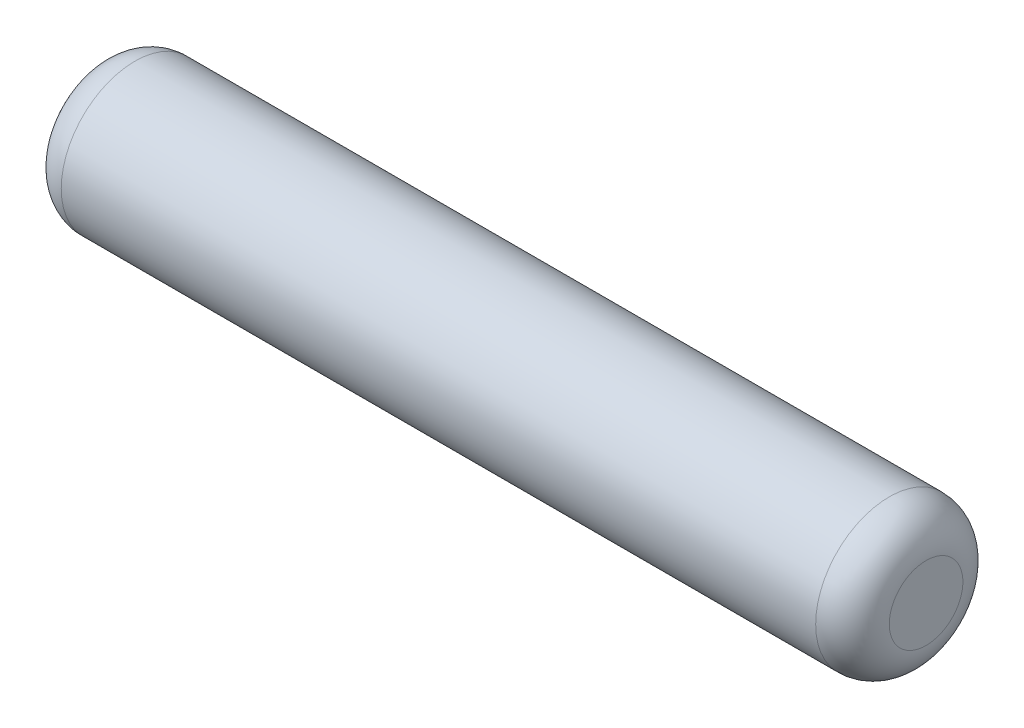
ISO-10303-21;
HEADER;
FILE_DESCRIPTION(('STEP AP214'),'2;1');
FILE_NAME('part.step','',(''),(''),'','','');
FILE_SCHEMA(('AUTOMOTIVE_DESIGN { 1 0 10303 214 1 1 1 1 }'));
ENDSEC;
DATA;
#1=APPLICATION_CONTEXT('core data for automotive mechanical design processes');
#2=APPLICATION_PROTOCOL_DEFINITION('international standard','automotive_design',2000,#1);
#3=PRODUCT_CONTEXT('',#1,'mechanical');
#4=PRODUCT('Part','Part','',(#3));
#5=PRODUCT_RELATED_PRODUCT_CATEGORY('part','',(#4));
#6=PRODUCT_DEFINITION_FORMATION('','',#4);
#7=PRODUCT_DEFINITION_CONTEXT('part definition',#1,'design');
#8=PRODUCT_DEFINITION('design','',#6,#7);
#9=PRODUCT_DEFINITION_SHAPE('','',#8);
#10=(LENGTH_UNIT() NAMED_UNIT(*) SI_UNIT(.MILLI.,.METRE.));
#11=(NAMED_UNIT(*) PLANE_ANGLE_UNIT() SI_UNIT($,.RADIAN.));
#12=(NAMED_UNIT(*) SI_UNIT($,.STERADIAN.) SOLID_ANGLE_UNIT());
#13=UNCERTAINTY_MEASURE_WITH_UNIT(LENGTH_MEASURE(1.E-05),#10,'distance_accuracy_value','');
#14=(GEOMETRIC_REPRESENTATION_CONTEXT(3) GLOBAL_UNCERTAINTY_ASSIGNED_CONTEXT((#13)) GLOBAL_UNIT_ASSIGNED_CONTEXT((#10,
#11,#12)) REPRESENTATION_CONTEXT('',''));
#15=CARTESIAN_POINT('',(0.,0.,0.));
#16=DIRECTION('',(0.,0.,1.));
#17=DIRECTION('',(1.,0.,0.));
#18=AXIS2_PLACEMENT_3D('',#15,#16,#17);
#19=CARTESIAN_POINT('',(0.,0.,0.));
#20=DIRECTION('',(1.,0.,0.));
#21=DIRECTION('',(0.,0.,-1.));
#22=AXIS2_PLACEMENT_3D('',#19,#20,#21);
#23=PLANE('',#22);
#24=CARTESIAN_POINT('',(0.,0.,0.));
#25=DIRECTION('',(1.,0.,0.));
#26=DIRECTION('',(0.,0.,-1.));
#27=AXIS2_PLACEMENT_3D('',#24,#25,#26);
#28=CIRCLE('',#27,2.);
#29=CARTESIAN_POINT('',(0.,0.,-2.));
#30=VERTEX_POINT('',#29);
#31=EDGE_CURVE('E29',#30,#30,#28,.F.);
#32=ORIENTED_EDGE('',*,*,#31,.T.);
#33=EDGE_LOOP('',(#32));
#34=FACE_BOUND('',#33,.T.);
#35=ADVANCED_FACE('F14',(#34),#23,.F.);
#36=CARTESIAN_POINT('',(0.,0.,0.));
#37=DIRECTION('',(-1.,0.,0.));
#38=DIRECTION('',(0.,0.,1.));
#39=AXIS2_PLACEMENT_3D('',#36,#37,#38);
#40=CYLINDRICAL_SURFACE('',#39,4.);
#41=CARTESIAN_POINT('',(2.,0.,0.));
#42=DIRECTION('',(1.,0.,0.));
#43=DIRECTION('',(0.,0.,-1.));
#44=AXIS2_PLACEMENT_3D('',#41,#42,#43);
#45=CIRCLE('',#44,4.);
#46=CARTESIAN_POINT('',(2.,0.,-4.));
#47=VERTEX_POINT('',#46);
#48=EDGE_CURVE('E21',#47,#47,#45,.T.);
#49=ORIENTED_EDGE('',*,*,#48,.T.);
#50=EDGE_LOOP('',(#49));
#51=FACE_BOUND('',#50,.T.);
#52=CARTESIAN_POINT('',(43.,0.,0.));
#53=DIRECTION('',(-1.,0.,0.));
#54=DIRECTION('',(0.,0.,1.));
#55=AXIS2_PLACEMENT_3D('',#52,#53,#54);
#56=CIRCLE('',#55,4.);
#57=CARTESIAN_POINT('',(43.,0.,4.));
#58=VERTEX_POINT('',#57);
#59=EDGE_CURVE('E25',#58,#58,#56,.T.);
#60=ORIENTED_EDGE('',*,*,#59,.T.);
#61=EDGE_LOOP('',(#60));
#62=FACE_BOUND('',#61,.T.);
#63=ADVANCED_FACE('F47',(#51,#62),#40,.T.);
#64=CARTESIAN_POINT('',(45.,4.,0.));
#65=DIRECTION('',(-1.,0.,0.));
#66=DIRECTION('',(0.,0.,1.));
#67=AXIS2_PLACEMENT_3D('',#64,#65,#66);
#68=PLANE('',#67);
#69=CARTESIAN_POINT('',(45.,0.,0.));
#70=DIRECTION('',(-1.,0.,0.));
#71=DIRECTION('',(0.,0.,1.));
#72=AXIS2_PLACEMENT_3D('',#69,#70,#71);
#73=CIRCLE('',#72,2.);
#74=CARTESIAN_POINT('',(45.,0.,2.));
#75=VERTEX_POINT('',#74);
#76=EDGE_CURVE('E9',#75,#75,#73,.F.);
#77=ORIENTED_EDGE('',*,*,#76,.T.);
#78=EDGE_LOOP('',(#77));
#79=FACE_BOUND('',#78,.T.);
#80=ADVANCED_FACE('F38',(#79),#68,.F.);
#81=CARTESIAN_POINT('',(2.,0.,0.));
#82=DIRECTION('',(1.,0.,0.));
#83=DIRECTION('',(0.,0.,-1.));
#84=AXIS2_PLACEMENT_3D('',#81,#82,#83);
#85=DEGENERATE_TOROIDAL_SURFACE('',#84,2.,2.,.T.);
#86=ORIENTED_EDGE('',*,*,#48,.F.);
#87=EDGE_LOOP('',(#86));
#88=FACE_BOUND('',#87,.T.);
#89=ORIENTED_EDGE('',*,*,#31,.F.);
#90=EDGE_LOOP('',(#89));
#91=FACE_BOUND('',#90,.T.);
#92=ADVANCED_FACE('F36',(#88,#91),#85,.T.);
#93=CARTESIAN_POINT('',(43.,0.,0.));
#94=DIRECTION('',(-1.,0.,0.));
#95=DIRECTION('',(0.,0.,1.));
#96=AXIS2_PLACEMENT_3D('',#93,#94,#95);
#97=DEGENERATE_TOROIDAL_SURFACE('',#96,2.,2.,.T.);
#98=ORIENTED_EDGE('',*,*,#76,.F.);
#99=EDGE_LOOP('',(#98));
#100=FACE_BOUND('',#99,.T.);
#101=ORIENTED_EDGE('',*,*,#59,.F.);
#102=EDGE_LOOP('',(#101));
#103=FACE_BOUND('',#102,.T.);
#104=ADVANCED_FACE('F16',(#100,#103),#97,.T.);
#105=CLOSED_SHELL('',(#35,#63,#80,#92,#104));
#106=MANIFOLD_SOLID_BREP('B1',#105);
#107=ADVANCED_BREP_SHAPE_REPRESENTATION('',(#18,#106),#14);
#108=SHAPE_DEFINITION_REPRESENTATION(#9,#107);
ENDSEC;
END-ISO-10303-21;
